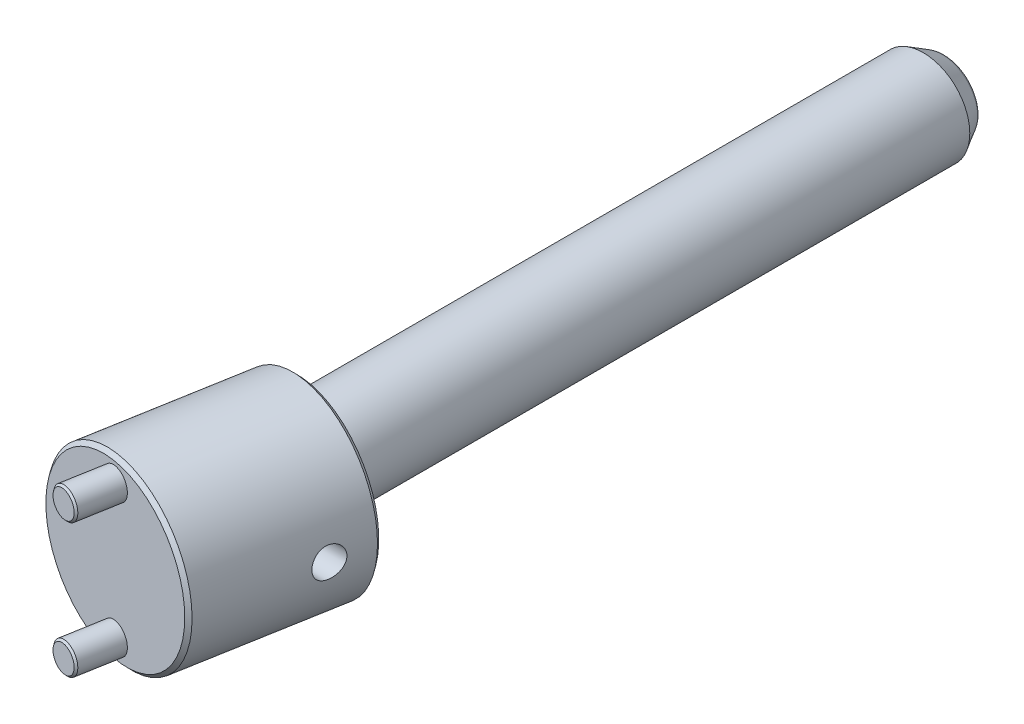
ISO-10303-21;
HEADER;
FILE_DESCRIPTION(('STEP AP214'),'2;1');
FILE_NAME('part.step','',(''),(''),'','','');
FILE_SCHEMA(('AUTOMOTIVE_DESIGN { 1 0 10303 214 1 1 1 1 }'));
ENDSEC;
DATA;
#1=APPLICATION_CONTEXT('core data for automotive mechanical design processes');
#2=APPLICATION_PROTOCOL_DEFINITION('international standard','automotive_design',2000,#1);
#3=PRODUCT_CONTEXT('',#1,'mechanical');
#4=PRODUCT('Part','Part','',(#3));
#5=PRODUCT_RELATED_PRODUCT_CATEGORY('part','',(#4));
#6=PRODUCT_DEFINITION_FORMATION('','',#4);
#7=PRODUCT_DEFINITION_CONTEXT('part definition',#1,'design');
#8=PRODUCT_DEFINITION('design','',#6,#7);
#9=PRODUCT_DEFINITION_SHAPE('','',#8);
#10=(LENGTH_UNIT() NAMED_UNIT(*) SI_UNIT(.MILLI.,.METRE.));
#11=(NAMED_UNIT(*) PLANE_ANGLE_UNIT() SI_UNIT($,.RADIAN.));
#12=(NAMED_UNIT(*) SI_UNIT($,.STERADIAN.) SOLID_ANGLE_UNIT());
#13=UNCERTAINTY_MEASURE_WITH_UNIT(LENGTH_MEASURE(1.E-05),#10,'distance_accuracy_value','');
#14=(GEOMETRIC_REPRESENTATION_CONTEXT(3) GLOBAL_UNCERTAINTY_ASSIGNED_CONTEXT((#13)) GLOBAL_UNIT_ASSIGNED_CONTEXT((#10,
#11,#12)) REPRESENTATION_CONTEXT('',''));
#15=CARTESIAN_POINT('',(0.,0.,0.));
#16=DIRECTION('',(0.,0.,1.));
#17=DIRECTION('',(1.,0.,0.));
#18=AXIS2_PLACEMENT_3D('',#15,#16,#17);
#19=CARTESIAN_POINT('',(0.,0.,-175.));
#20=DIRECTION('',(0.,0.,-1.));
#21=DIRECTION('',(0.,1.,0.));
#22=AXIS2_PLACEMENT_3D('',#19,#20,#21);
#23=PLANE('',#22);
#24=CARTESIAN_POINT('',(0.,0.,-175.));
#25=DIRECTION('',(0.,0.,1.));
#26=DIRECTION('',(-1.,0.,0.));
#27=AXIS2_PLACEMENT_3D('',#24,#25,#26);
#28=CIRCLE('',#27,7.881197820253);
#29=CARTESIAN_POINT('',(-7.881197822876,0.,-175.));
#30=VERTEX_POINT('',#29);
#31=CARTESIAN_POINT('',(7.881197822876,0.,-175.));
#32=VERTEX_POINT('',#31);
#33=EDGE_CURVE('P0_E38',#30,#32,#28,.T.);
#34=ORIENTED_EDGE('',*,*,#33,.F.);
#35=CARTESIAN_POINT('',(0.,0.,-175.));
#36=DIRECTION('',(0.,0.,1.));
#37=DIRECTION('',(1.,0.,0.));
#38=AXIS2_PLACEMENT_3D('',#35,#36,#37);
#39=CIRCLE('',#38,7.881197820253);
#40=EDGE_CURVE('P0_E42',#32,#30,#39,.T.);
#41=ORIENTED_EDGE('',*,*,#40,.F.);
#42=EDGE_LOOP('',(#34,#41));
#43=FACE_BOUND('',#42,.T.);
#44=ADVANCED_FACE('P0_F17',(#43),#23,.T.);
#45=CARTESIAN_POINT('',(0.,0.,-173.));
#46=DIRECTION('',(0.,0.,-1.));
#47=DIRECTION('',(0.999976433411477,-0.00686532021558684,0.));
#48=AXIS2_PLACEMENT_3D('',#45,#46,#47);
#49=TOROIDAL_SURFACE('',#48,7.881197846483,2.);
#50=ORIENTED_EDGE('',*,*,#33,.T.);
#51=ORIENTED_EDGE('',*,*,#40,.T.);
#52=EDGE_LOOP('',(#50,#51));
#53=FACE_BOUND('',#52,.T.);
#54=CARTESIAN_POINT('',(0.,0.,-174.000000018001));
#55=DIRECTION('',(0.,0.,1.));
#56=DIRECTION('',(1.,0.,0.));
#57=AXIS2_PLACEMENT_3D('',#54,#55,#56);
#58=CIRCLE('',#57,9.61324864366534);
#59=CARTESIAN_POINT('',(9.61324864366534,0.,-174.000000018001));
#60=VERTEX_POINT('',#59);
#61=EDGE_CURVE('P0_E48',#60,#60,#58,.T.);
#62=ORIENTED_EDGE('',*,*,#61,.F.);
#63=EDGE_LOOP('',(#62));
#64=FACE_BOUND('',#63,.T.);
#65=ADVANCED_FACE('P0_F40',(#53,#64),#49,.T.);
#66=CARTESIAN_POINT('',(0.,0.,37.5));
#67=DIRECTION('',(0.,0.,-1.));
#68=DIRECTION('',(0.,1.,0.));
#69=AXIS2_PLACEMENT_3D('',#66,#67,#68);
#70=PLANE('',#69);
#71=CARTESIAN_POINT('',(0.,0.,37.4999993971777));
#72=DIRECTION('',(0.,0.,-1.));
#73=DIRECTION('',(0.,1.,0.));
#74=AXIS2_PLACEMENT_3D('',#71,#72,#73);
#75=CIRCLE('',#74,11.4999991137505);
#76=CARTESIAN_POINT('',(0.,11.4999991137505,37.4999993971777));
#77=VERTEX_POINT('',#76);
#78=EDGE_CURVE('P0_E85',#77,#77,#75,.T.);
#79=ORIENTED_EDGE('',*,*,#78,.F.);
#80=EDGE_LOOP('',(#79));
#81=FACE_BOUND('',#80,.T.);
#82=ADVANCED_FACE('P0_F76',(#81),#70,.F.);
#83=CARTESIAN_POINT('',(4.30940107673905,0.,17.));
#84=DIRECTION('',(1.,0.,0.));
#85=DIRECTION('',(0.,0.,1.));
#86=AXIS2_PLACEMENT_3D('',#83,#84,#85);
#87=CONICAL_SURFACE('',#86,3.9999999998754,1.04719755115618);
#88=CARTESIAN_POINT('',(1.99999999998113,0.,16.9999999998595));
#89=VERTEX_POINT('',#88);
#90=VERTEX_LOOP('',#89);
#91=FACE_BOUND('',#90,.T.);
#92=CARTESIAN_POINT('',(4.309401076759,0.,17.));
#93=DIRECTION('',(1.,0.,0.));
#94=DIRECTION('',(0.,0.,1.));
#95=AXIS2_PLACEMENT_3D('',#92,#93,#94);
#96=CIRCLE('',#95,4.);
#97=CARTESIAN_POINT('',(4.309401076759,0.,21.));
#98=VERTEX_POINT('',#97);
#99=EDGE_CURVE('P0_E82',#98,#98,#96,.T.);
#100=ORIENTED_EDGE('',*,*,#99,.T.);
#101=EDGE_LOOP('',(#100));
#102=FACE_BOUND('',#101,.T.);
#103=ADVANCED_FACE('P0_F116',(#91,#102),#87,.F.);
#104=CARTESIAN_POINT('',(0.,0.,-169.000000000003));
#105=DIRECTION('',(0.,0.,1.));
#106=DIRECTION('',(0.,-1.,0.));
#107=AXIS2_PLACEMENT_3D('',#104,#105,#106);
#108=CONICAL_SURFACE('',#107,12.5000000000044,0.5235987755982);
#109=CARTESIAN_POINT('',(0.,0.,-169.));
#110=DIRECTION('',(0.,0.,-1.));
#111=DIRECTION('',(0.,1.,0.));
#112=AXIS2_PLACEMENT_3D('',#109,#110,#111);
#113=CIRCLE('',#112,12.5);
#114=CARTESIAN_POINT('',(0.,12.5,-169.));
#115=VERTEX_POINT('',#114);
#116=EDGE_CURVE('P0_E92',#115,#115,#113,.F.);
#117=ORIENTED_EDGE('',*,*,#116,.F.);
#118=EDGE_LOOP('',(#117));
#119=FACE_BOUND('',#118,.T.);
#120=ORIENTED_EDGE('',*,*,#61,.T.);
#121=EDGE_LOOP('',(#120));
#122=FACE_BOUND('',#121,.T.);
#123=ADVANCED_FACE('P0_F108',(#119,#122),#108,.T.);
#124=CARTESIAN_POINT('',(0.,0.,36.4999990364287));
#125=DIRECTION('',(0.,0.,-1.));
#126=DIRECTION('',(0.,1.,0.));
#127=AXIS2_PLACEMENT_3D('',#124,#125,#126);
#128=CONICAL_SURFACE('',#127,12.4999993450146,0.78539809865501);
#129=CARTESIAN_POINT('',(0.,0.,36.499999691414));
#130=DIRECTION('',(0.,0.,-1.));
#131=DIRECTION('',(0.,1.,0.));
#132=AXIS2_PLACEMENT_3D('',#129,#130,#131);
#133=CIRCLE('',#132,12.5);
#134=CARTESIAN_POINT('',(0.,12.5,36.499999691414));
#135=VERTEX_POINT('',#134);
#136=EDGE_CURVE('P0_E28',#135,#135,#133,.T.);
#137=ORIENTED_EDGE('',*,*,#136,.F.);
#138=EDGE_LOOP('',(#137));
#139=FACE_BOUND('',#138,.T.);
#140=ORIENTED_EDGE('',*,*,#78,.T.);
#141=EDGE_LOOP('',(#140));
#142=FACE_BOUND('',#141,.T.);
#143=ADVANCED_FACE('P0_F105',(#139,#142),#128,.T.);
#144=CARTESIAN_POINT('',(1.375,0.,17.));
#145=DIRECTION('',(1.,0.,0.));
#146=DIRECTION('',(0.,0.,1.));
#147=AXIS2_PLACEMENT_3D('',#144,#145,#146);
#148=CYLINDRICAL_SURFACE('',#147,4.);
#149=ORIENTED_EDGE('',*,*,#99,.F.);
#150=EDGE_LOOP('',(#149));
#151=FACE_BOUND('',#150,.T.);
#152=CARTESIAN_POINT('',(12.5,0.,21.));
#153=CARTESIAN_POINT('',(12.4999998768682,0.109267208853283,20.9999998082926));
#154=CARTESIAN_POINT('',(12.4985638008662,0.218537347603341,20.9955187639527));
#155=CARTESIAN_POINT('',(12.4928582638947,0.436308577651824,20.9776347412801));
#156=CARTESIAN_POINT('',(12.4885877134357,0.544809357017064,20.9642283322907));
#157=CARTESIAN_POINT('',(12.4773197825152,0.760358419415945,20.9285872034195));
#158=CARTESIAN_POINT('',(12.4703188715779,0.867404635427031,20.9063410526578));
#159=CARTESIAN_POINT('',(12.4537844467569,1.07914970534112,20.853228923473));
#160=CARTESIAN_POINT('',(12.4442499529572,1.18384763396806,20.8223596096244));
#161=CARTESIAN_POINT('',(12.412260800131,1.49277788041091,20.7173557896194));
#162=CARTESIAN_POINT('',(12.3863805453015,1.69256281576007,20.6307055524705));
#163=CARTESIAN_POINT('',(12.3281610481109,2.07458913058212,20.4268128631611));
#164=CARTESIAN_POINT('',(12.295822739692,2.25683304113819,20.3095748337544));
#165=CARTESIAN_POINT('',(12.2269279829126,2.60472253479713,20.043795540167));
#166=CARTESIAN_POINT('',(12.1902760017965,2.76972880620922,19.8944408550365));
#167=CARTESIAN_POINT('',(12.1174284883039,3.07283077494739,19.5704010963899));
#168=CARTESIAN_POINT('',(12.0812330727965,3.21091970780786,19.3957096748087));
#169=CARTESIAN_POINT('',(12.01237020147,3.45978450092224,19.0203675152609));
#170=CARTESIAN_POINT('',(11.9798194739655,3.56975347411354,18.8191582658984));
#171=CARTESIAN_POINT('',(11.9233663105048,3.75402351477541,18.399892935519));
#172=CARTESIAN_POINT('',(11.8994614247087,3.82833468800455,18.1818416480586));
#173=CARTESIAN_POINT('',(11.8640030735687,3.93682830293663,17.7422935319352));
#174=CARTESIAN_POINT('',(11.8520853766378,3.97219740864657,17.5211198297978));
#175=CARTESIAN_POINT('',(11.8408707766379,4.00551082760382,17.0756810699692));
#176=CARTESIAN_POINT('',(11.8415703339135,4.00346563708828,16.8514168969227));
#177=CARTESIAN_POINT('',(11.8551904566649,3.96293460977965,16.4160865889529));
#178=CARTESIAN_POINT('',(11.8676003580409,3.92597140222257,16.2048599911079));
#179=CARTESIAN_POINT('',(11.9024113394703,3.81912665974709,15.791778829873));
#180=CARTESIAN_POINT('',(11.9248135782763,3.74924130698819,15.5899253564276));
#181=CARTESIAN_POINT('',(11.9774670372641,3.5774893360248,15.1977500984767));
#182=CARTESIAN_POINT('',(12.0078322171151,3.47515345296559,15.0076498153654));
#183=CARTESIAN_POINT('',(12.0729382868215,3.2417276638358,14.6468343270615));
#184=CARTESIAN_POINT('',(12.107680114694,3.11063158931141,14.4761232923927));
#185=CARTESIAN_POINT('',(12.1796519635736,2.81604951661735,14.1503715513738));
#186=CARTESIAN_POINT('',(12.2169216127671,2.65131653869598,13.9964671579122));
#187=CARTESIAN_POINT('',(12.2883204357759,2.29773509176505,13.7180823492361));
#188=CARTESIAN_POINT('',(12.3224482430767,2.10887621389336,13.5936147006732));
#189=CARTESIAN_POINT('',(12.368603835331,1.8105187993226,13.4313785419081));
#190=CARTESIAN_POINT('',(12.3832112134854,1.70799133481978,13.3811846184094));
#191=CARTESIAN_POINT('',(12.4102662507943,1.49879447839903,13.2896595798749));
#192=CARTESIAN_POINT('',(12.4227147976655,1.39212681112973,13.2483248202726));
#193=CARTESIAN_POINT('',(12.4450730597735,1.17558171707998,13.1749428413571));
#194=CARTESIAN_POINT('',(12.4549867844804,1.0657096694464,13.1428809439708));
#195=CARTESIAN_POINT('',(12.4720081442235,0.843458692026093,13.0882661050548));
#196=CARTESIAN_POINT('',(12.4791170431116,0.731080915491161,13.0657088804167));
#197=CARTESIAN_POINT('',(12.4897717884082,0.515800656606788,13.0320501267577));
#198=CARTESIAN_POINT('',(12.4935992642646,0.413053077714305,13.0200402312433));
#199=CARTESIAN_POINT('',(12.498713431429,0.206871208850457,13.0040150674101));
#200=CARTESIAN_POINT('',(12.5000001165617,0.103436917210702,12.9999998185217));
#201=CARTESIAN_POINT('',(12.4999998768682,-0.109267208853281,13.0000001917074));
#202=CARTESIAN_POINT('',(12.4985638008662,-0.218537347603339,13.0044812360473));
#203=CARTESIAN_POINT('',(12.4928582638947,-0.436308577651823,13.0223652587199));
#204=CARTESIAN_POINT('',(12.4885877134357,-0.544809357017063,13.0357716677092));
#205=CARTESIAN_POINT('',(12.4773197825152,-0.760358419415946,13.0714127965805));
#206=CARTESIAN_POINT('',(12.4703188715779,-0.867404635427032,13.0936589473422));
#207=CARTESIAN_POINT('',(12.4537844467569,-1.07914970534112,13.146771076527));
#208=CARTESIAN_POINT('',(12.4442499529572,-1.18384763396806,13.1776403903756));
#209=CARTESIAN_POINT('',(12.412260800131,-1.4927778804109,13.2826442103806));
#210=CARTESIAN_POINT('',(12.3863805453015,-1.69256281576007,13.3692944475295));
#211=CARTESIAN_POINT('',(12.3281610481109,-2.07458913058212,13.5731871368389));
#212=CARTESIAN_POINT('',(12.295822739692,-2.25683304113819,13.6904251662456));
#213=CARTESIAN_POINT('',(12.2269279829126,-2.60472253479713,13.956204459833));
#214=CARTESIAN_POINT('',(12.1902760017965,-2.76972880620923,14.1055591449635));
#215=CARTESIAN_POINT('',(12.1174284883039,-3.0728307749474,14.4295989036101));
#216=CARTESIAN_POINT('',(12.0812330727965,-3.21091970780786,14.6042903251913));
#217=CARTESIAN_POINT('',(12.01237020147,-3.45978450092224,14.9796324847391));
#218=CARTESIAN_POINT('',(11.9798194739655,-3.56975347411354,15.1808417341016));
#219=CARTESIAN_POINT('',(11.9233663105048,-3.75402351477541,15.600107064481));
#220=CARTESIAN_POINT('',(11.8994614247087,-3.82833468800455,15.8181583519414));
#221=CARTESIAN_POINT('',(11.8640030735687,-3.93682830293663,16.2577064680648));
#222=CARTESIAN_POINT('',(11.8520853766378,-3.97219740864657,16.4788801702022));
#223=CARTESIAN_POINT('',(11.8408707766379,-4.00551082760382,16.9243189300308));
#224=CARTESIAN_POINT('',(11.8415703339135,-4.00346563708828,17.1485831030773));
#225=CARTESIAN_POINT('',(11.8551904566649,-3.96293460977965,17.583913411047));
#226=CARTESIAN_POINT('',(11.8676003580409,-3.92597140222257,17.7951400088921));
#227=CARTESIAN_POINT('',(11.9024113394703,-3.81912665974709,18.208221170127));
#228=CARTESIAN_POINT('',(11.9248135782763,-3.74924130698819,18.4100746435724));
#229=CARTESIAN_POINT('',(11.9774670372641,-3.5774893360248,18.8022499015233));
#230=CARTESIAN_POINT('',(12.0078322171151,-3.47515345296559,18.9923501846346));
#231=CARTESIAN_POINT('',(12.0729382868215,-3.2417276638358,19.3531656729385));
#232=CARTESIAN_POINT('',(12.107680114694,-3.11063158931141,19.5238767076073));
#233=CARTESIAN_POINT('',(12.1796519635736,-2.81604951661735,19.8496284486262));
#234=CARTESIAN_POINT('',(12.2169216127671,-2.65131653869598,20.0035328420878));
#235=CARTESIAN_POINT('',(12.2883204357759,-2.29773509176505,20.2819176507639));
#236=CARTESIAN_POINT('',(12.3224482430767,-2.10887621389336,20.4063852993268));
#237=CARTESIAN_POINT('',(12.368603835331,-1.8105187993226,20.5686214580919));
#238=CARTESIAN_POINT('',(12.3832112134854,-1.70799133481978,20.6188153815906));
#239=CARTESIAN_POINT('',(12.4102662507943,-1.49879447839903,20.7103404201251));
#240=CARTESIAN_POINT('',(12.4227147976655,-1.39212681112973,20.7516751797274));
#241=CARTESIAN_POINT('',(12.4450730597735,-1.17558171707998,20.8250571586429));
#242=CARTESIAN_POINT('',(12.4549867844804,-1.0657096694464,20.8571190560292));
#243=CARTESIAN_POINT('',(12.4720081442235,-0.843458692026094,20.9117338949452));
#244=CARTESIAN_POINT('',(12.4791170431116,-0.731080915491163,20.9342911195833));
#245=CARTESIAN_POINT('',(12.4897717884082,-0.515800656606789,20.9679498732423));
#246=CARTESIAN_POINT('',(12.4935992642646,-0.413053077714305,20.9799597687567));
#247=CARTESIAN_POINT('',(12.498713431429,-0.206871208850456,20.9959849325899));
#248=CARTESIAN_POINT('',(12.5000001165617,-0.103436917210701,21.0000001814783));
#249=CARTESIAN_POINT('',(12.5,0.,21.));
#250=B_SPLINE_CURVE_WITH_KNOTS('',3,(#152,#153,#154,#155,#156,#157,#158,#159,#160,#161,#162,
#163,#164,#165,#166,#167,#168,#169,#170,#171,#172,#173,#174,#175,#176,#177,#178,#179,#180,#181,
#182,#183,#184,#185,#186,#187,#188,#189,#190,#191,#192,#193,#194,#195,#196,#197,#198,#199,#200,
#201,#202,#203,#204,#205,#206,#207,#208,#209,#210,#211,#212,#213,#214,#215,#216,#217,#218,#219,
#220,#221,#222,#223,#224,#225,#226,#227,#228,#229,#230,#231,#232,#233,#234,#235,#236,#237,#238,
#239,#240,#241,#242,#243,#244,#245,#246,#247,#248,#249),.UNSPECIFIED.,.T.,.F.,(4,2,2,2,2,2,2,2,
2,2,2,2,2,2,2,2,2,2,2,2,2,2,2,2,2,2,2,2,2,2,2,2,2,2,2,2,2,2,2,2,2,2,2,2,2,2,2,2,4),(0.,
0.327705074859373,0.655536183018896,0.983792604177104,1.31217617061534,1.96678919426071,
2.62130761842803,3.29492000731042,3.96870146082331,4.66006760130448,5.35123768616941,
6.0207071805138,6.68998886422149,7.33137068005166,7.97282689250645,8.62401811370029,
9.27534913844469,9.95775723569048,10.6404607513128,10.9853574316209,11.3301119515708,
11.6743177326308,12.0183682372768,12.3285868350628,12.6388061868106,12.9665112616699,
13.2943423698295,13.6225987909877,13.9509823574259,14.6055953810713,15.2601138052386,
15.933726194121,16.6075076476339,17.298873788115,17.99004387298,18.6595133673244,
19.3287950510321,19.9701768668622,20.611633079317,21.2628243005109,21.9141553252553,
22.596563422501,23.2792669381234,23.6241636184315,23.9689181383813,24.3131239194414,
24.6571744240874,24.9673930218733,25.2776123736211),.UNSPECIFIED.);
#251=CARTESIAN_POINT('',(12.5,0.,21.));
#252=VERTEX_POINT('',#251);
#253=EDGE_CURVE('P0_E11',#252,#252,#250,.T.);
#254=ORIENTED_EDGE('',*,*,#253,.F.);
#255=EDGE_LOOP('',(#254));
#256=FACE_BOUND('',#255,.T.);
#257=ADVANCED_FACE('P0_F107',(#151,#256),#148,.F.);
#258=CARTESIAN_POINT('',(0.,0.,48.125));
#259=DIRECTION('',(0.,0.,-1.));
#260=DIRECTION('',(0.,1.,0.));
#261=AXIS2_PLACEMENT_3D('',#258,#259,#260);
#262=CYLINDRICAL_SURFACE('',#261,12.5);
#263=ORIENTED_EDGE('',*,*,#116,.T.);
#264=EDGE_LOOP('',(#263));
#265=FACE_BOUND('',#264,.T.);
#266=ORIENTED_EDGE('',*,*,#136,.T.);
#267=EDGE_LOOP('',(#266));
#268=FACE_BOUND('',#267,.T.);
#269=ORIENTED_EDGE('',*,*,#253,.T.);
#270=EDGE_LOOP('',(#269));
#271=FACE_BOUND('',#270,.T.);
#272=ADVANCED_FACE('P0_F102',(#265,#268,#271),#262,.T.);
#273=CLOSED_SHELL('',(#44,#65,#82,#103,#123,#143,#257,#272));
#274=MANIFOLD_SOLID_BREP('P0_B1',#273);
#275=CARTESIAN_POINT('',(-4.97390736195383,0.,57.0022828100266));
#276=DIRECTION('',(-0.173648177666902,0.,0.984807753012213));
#277=DIRECTION('',(-0.984807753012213,0.,-0.173648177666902));
#278=AXIS2_PLACEMENT_3D('',#275,#276,#277);
#279=PLANE('',#278);
#280=CARTESIAN_POINT('',(-4.97390736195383,18.,57.0022828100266));
#281=DIRECTION('',(-0.173648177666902,0.,0.984807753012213));
#282=DIRECTION('',(-0.984807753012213,0.,-0.173648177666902));
#283=AXIS2_PLACEMENT_3D('',#280,#281,#282);
#284=CIRCLE('',#283,3.50000030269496);
#285=CARTESIAN_POINT('',(-8.42073479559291,18.,56.39451413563));
#286=VERTEX_POINT('',#285);
#287=EDGE_CURVE('P1_E17',#286,#286,#284,.F.);
#288=ORIENTED_EDGE('',*,*,#287,.F.);
#289=EDGE_LOOP('',(#288));
#290=FACE_BOUND('',#289,.T.);
#291=ADVANCED_FACE('P1_F14',(#290),#279,.T.);
#292=CARTESIAN_POINT('',(-4.97390736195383,0.,57.0022828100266));
#293=DIRECTION('',(-0.173648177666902,0.,0.984807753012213));
#294=DIRECTION('',(-0.984807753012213,0.,-0.173648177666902));
#295=AXIS2_PLACEMENT_3D('',#292,#293,#294);
#296=PLANE('',#295);
#297=CARTESIAN_POINT('',(-4.97390736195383,-18.,57.0022828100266));
#298=DIRECTION('',(-0.173648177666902,0.,0.984807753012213));
#299=DIRECTION('',(-0.984807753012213,0.,-0.173648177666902));
#300=AXIS2_PLACEMENT_3D('',#297,#298,#299);
#301=CIRCLE('',#300,3.50000030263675);
#302=CARTESIAN_POINT('',(-8.42073479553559,-18.,56.3945141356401));
#303=VERTEX_POINT('',#302);
#304=EDGE_CURVE('P1_E121',#303,#303,#301,.F.);
#305=ORIENTED_EDGE('',*,*,#304,.F.);
#306=EDGE_LOOP('',(#305));
#307=FACE_BOUND('',#306,.T.);
#308=ADVANCED_FACE('P1_F111',(#307),#296,.T.);
#309=CARTESIAN_POINT('',(-3.17454396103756E-13,0.,37.4999999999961));
#310=DIRECTION('',(0.,0.,1.));
#311=DIRECTION('',(-1.,0.,0.));
#312=AXIS2_PLACEMENT_3D('',#309,#310,#311);
#313=PLANE('',#312);
#314=CARTESIAN_POINT('',(-1.48579065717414E-12,0.,37.4999999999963));
#315=DIRECTION('',(0.,0.,1.));
#316=DIRECTION('',(-1.,0.,0.));
#317=AXIS2_PLACEMENT_3D('',#314,#315,#316);
#318=CIRCLE('',#317,12.5);
#319=CARTESIAN_POINT('',(-12.5000000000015,0.,37.4999999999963));
#320=VERTEX_POINT('',#319);
#321=EDGE_CURVE('P1_E36',#320,#320,#318,.F.);
#322=ORIENTED_EDGE('',*,*,#321,.T.);
#323=EDGE_LOOP('',(#322));
#324=FACE_BOUND('',#323,.T.);
#325=ADVANCED_FACE('P1_F108',(#324),#313,.F.);
#326=CARTESIAN_POINT('',(-4.88708307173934,18.,56.5098777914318));
#327=DIRECTION('',(0.173648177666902,0.,-0.984807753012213));
#328=DIRECTION('',(0.984807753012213,0.,0.173648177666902));
#329=AXIS2_PLACEMENT_3D('',#326,#327,#328);
#330=CONICAL_SURFACE('',#329,4.00000150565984,0.785398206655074);
#331=CARTESIAN_POINT('',(-4.88708281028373,18.,56.5098763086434));
#332=DIRECTION('',(-0.173648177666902,0.,0.984807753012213));
#333=DIRECTION('',(-0.984807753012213,0.,-0.173648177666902));
#334=AXIS2_PLACEMENT_3D('',#331,#332,#333);
#335=CIRCLE('',#334,4.);
#336=CARTESIAN_POINT('',(-8.82631382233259,18.,55.8152835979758));
#337=VERTEX_POINT('',#336);
#338=EDGE_CURVE('P1_E33',#337,#337,#335,.F.);
#339=ORIENTED_EDGE('',*,*,#338,.F.);
#340=EDGE_LOOP('',(#339));
#341=FACE_BOUND('',#340,.T.);
#342=ORIENTED_EDGE('',*,*,#287,.T.);
#343=EDGE_LOOP('',(#342));
#344=FACE_BOUND('',#343,.T.);
#345=ADVANCED_FACE('P1_F104',(#341,#344),#330,.T.);
#346=CARTESIAN_POINT('',(-4.88708307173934,-18.,56.5098777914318));
#347=DIRECTION('',(0.173648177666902,0.,-0.984807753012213));
#348=DIRECTION('',(0.984807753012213,0.,0.173648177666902));
#349=AXIS2_PLACEMENT_3D('',#346,#347,#348);
#350=CONICAL_SURFACE('',#349,4.00000150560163,0.785398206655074);
#351=CARTESIAN_POINT('',(-4.88708281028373,-18.,56.5098763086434));
#352=DIRECTION('',(-0.173648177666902,0.,0.984807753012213));
#353=DIRECTION('',(-0.984807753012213,0.,-0.173648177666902));
#354=AXIS2_PLACEMENT_3D('',#351,#352,#353);
#355=CIRCLE('',#354,4.);
#356=CARTESIAN_POINT('',(-8.82631382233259,-18.,55.8152835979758));
#357=VERTEX_POINT('',#356);
#358=EDGE_CURVE('P1_E29',#357,#357,#355,.F.);
#359=ORIENTED_EDGE('',*,*,#358,.F.);
#360=EDGE_LOOP('',(#359));
#361=FACE_BOUND('',#360,.T.);
#362=ORIENTED_EDGE('',*,*,#304,.T.);
#363=EDGE_LOOP('',(#362));
#364=FACE_BOUND('',#363,.T.);
#365=ADVANCED_FACE('P1_F99',(#361,#364),#350,.T.);
#366=CARTESIAN_POINT('',(-1.48752538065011E-12,0.,-14.7263884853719));
#367=DIRECTION('',(0.,0.,1.));
#368=DIRECTION('',(-1.,0.,0.));
#369=AXIS2_PLACEMENT_3D('',#366,#367,#368);
#370=CYLINDRICAL_SURFACE('',#369,12.5);
#371=CARTESIAN_POINT('',(-1.48665801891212E-12,0.,-4.10088629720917E-12));
#372=DIRECTION('',(0.173648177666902,0.,-0.984807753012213));
#373=DIRECTION('',(0.984807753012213,0.,0.173648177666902));
#374=AXIS2_PLACEMENT_3D('',#371,#372,#373);
#375=ELLIPSE('',#374,12.6928326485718,12.5);
#376=CARTESIAN_POINT('',(12.4999999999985,0.,2.20408725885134));
#377=VERTEX_POINT('',#376);
#378=EDGE_CURVE('P1_E32',#377,#377,#375,.F.);
#379=ORIENTED_EDGE('',*,*,#378,.F.);
#380=EDGE_LOOP('',(#379));
#381=FACE_BOUND('',#380,.T.);
#382=ORIENTED_EDGE('',*,*,#321,.F.);
#383=EDGE_LOOP('',(#382));
#384=FACE_BOUND('',#383,.T.);
#385=CARTESIAN_POINT('',(12.4999999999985,0.,12.9999999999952));
#386=CARTESIAN_POINT('',(12.4999998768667,0.109267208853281,13.0000001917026));
#387=CARTESIAN_POINT('',(12.4985638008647,0.218537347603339,13.0044812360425));
#388=CARTESIAN_POINT('',(12.4928582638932,0.436308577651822,13.0223652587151));
#389=CARTESIAN_POINT('',(12.4885877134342,0.544809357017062,13.0357716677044));
#390=CARTESIAN_POINT('',(12.4773197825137,0.760358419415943,13.0714127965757));
#391=CARTESIAN_POINT('',(12.4703188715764,0.867404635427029,13.0936589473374));
#392=CARTESIAN_POINT('',(12.4537844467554,1.07914970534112,13.1467710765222));
#393=CARTESIAN_POINT('',(12.4442499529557,1.18384763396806,13.1776403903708));
#394=CARTESIAN_POINT('',(12.4122608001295,1.4927778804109,13.2826442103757));
#395=CARTESIAN_POINT('',(12.3863805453,1.69256281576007,13.3692944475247));
#396=CARTESIAN_POINT('',(12.3281610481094,2.07458913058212,13.5731871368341));
#397=CARTESIAN_POINT('',(12.2958227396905,2.25683304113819,13.6904251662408));
#398=CARTESIAN_POINT('',(12.2269279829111,2.60472253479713,13.9562044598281));
#399=CARTESIAN_POINT('',(12.190276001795,2.76972880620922,14.1055591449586));
#400=CARTESIAN_POINT('',(12.1174284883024,3.07283077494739,14.4295989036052));
#401=CARTESIAN_POINT('',(12.081233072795,3.21091970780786,14.6042903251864));
#402=CARTESIAN_POINT('',(12.0123702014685,3.45978450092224,14.9796324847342));
#403=CARTESIAN_POINT('',(11.979819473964,3.56975347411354,15.1808417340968));
#404=CARTESIAN_POINT('',(11.9233663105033,3.75402351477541,15.6001070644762));
#405=CARTESIAN_POINT('',(11.8994614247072,3.82833468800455,15.8181583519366));
#406=CARTESIAN_POINT('',(11.8640030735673,3.93682830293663,16.2577064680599));
#407=CARTESIAN_POINT('',(11.8520853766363,3.97219740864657,16.4788801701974));
#408=CARTESIAN_POINT('',(11.8408707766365,4.00551082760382,16.924318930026));
#409=CARTESIAN_POINT('',(11.841570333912,4.00346563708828,17.1485831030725));
#410=CARTESIAN_POINT('',(11.8551904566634,3.96293460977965,17.5839134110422));
#411=CARTESIAN_POINT('',(11.8676003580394,3.92597140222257,17.7951400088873));
#412=CARTESIAN_POINT('',(11.9024113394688,3.81912665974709,18.2082211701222));
#413=CARTESIAN_POINT('',(11.9248135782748,3.74924130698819,18.4100746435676));
#414=CARTESIAN_POINT('',(11.9774670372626,3.5774893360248,18.8022499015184));
#415=CARTESIAN_POINT('',(12.0078322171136,3.47515345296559,18.9923501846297));
#416=CARTESIAN_POINT('',(12.07293828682,3.2417276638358,19.3531656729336));
#417=CARTESIAN_POINT('',(12.1076801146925,3.11063158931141,19.5238767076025));
#418=CARTESIAN_POINT('',(12.1796519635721,2.81604951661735,19.8496284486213));
#419=CARTESIAN_POINT('',(12.2169216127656,2.65131653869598,20.0035328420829));
#420=CARTESIAN_POINT('',(12.2883204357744,2.29773509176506,20.2819176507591));
#421=CARTESIAN_POINT('',(12.3224482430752,2.10887621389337,20.406385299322));
#422=CARTESIAN_POINT('',(12.3686038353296,1.81051879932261,20.568621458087));
#423=CARTESIAN_POINT('',(12.3832112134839,1.70799133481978,20.6188153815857));
#424=CARTESIAN_POINT('',(12.4102662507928,1.49879447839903,20.7103404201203));
#425=CARTESIAN_POINT('',(12.422714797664,1.39212681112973,20.7516751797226));
#426=CARTESIAN_POINT('',(12.445073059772,1.17558171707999,20.825057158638));
#427=CARTESIAN_POINT('',(12.4549867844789,1.06570966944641,20.8571190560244));
#428=CARTESIAN_POINT('',(12.472008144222,0.843458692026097,20.9117338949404));
#429=CARTESIAN_POINT('',(12.4791170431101,0.731080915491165,20.9342911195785));
#430=CARTESIAN_POINT('',(12.4897717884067,0.515800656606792,20.9679498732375));
#431=CARTESIAN_POINT('',(12.4935992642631,0.413053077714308,20.9799597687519));
#432=CARTESIAN_POINT('',(12.4987134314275,0.206871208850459,20.995984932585));
#433=CARTESIAN_POINT('',(12.5000001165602,0.103436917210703,21.0000001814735));
#434=CARTESIAN_POINT('',(12.4999998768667,-0.109267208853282,20.9999998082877));
#435=CARTESIAN_POINT('',(12.4985638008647,-0.21853734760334,20.9955187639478));
#436=CARTESIAN_POINT('',(12.4928582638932,-0.436308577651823,20.9776347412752));
#437=CARTESIAN_POINT('',(12.4885877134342,-0.544809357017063,20.9642283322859));
#438=CARTESIAN_POINT('',(12.4773197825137,-0.760358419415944,20.9285872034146));
#439=CARTESIAN_POINT('',(12.4703188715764,-0.86740463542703,20.9063410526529));
#440=CARTESIAN_POINT('',(12.4537844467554,-1.07914970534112,20.8532289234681));
#441=CARTESIAN_POINT('',(12.4442499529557,-1.18384763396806,20.8223596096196));
#442=CARTESIAN_POINT('',(12.4122608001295,-1.4927778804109,20.7173557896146));
#443=CARTESIAN_POINT('',(12.3863805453,-1.69256281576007,20.6307055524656));
#444=CARTESIAN_POINT('',(12.3281610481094,-2.07458913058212,20.4268128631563));
#445=CARTESIAN_POINT('',(12.2958227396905,-2.25683304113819,20.3095748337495));
#446=CARTESIAN_POINT('',(12.2269279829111,-2.60472253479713,20.0437955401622));
#447=CARTESIAN_POINT('',(12.190276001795,-2.76972880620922,19.8944408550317));
#448=CARTESIAN_POINT('',(12.1174284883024,-3.07283077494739,19.5704010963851));
#449=CARTESIAN_POINT('',(12.081233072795,-3.21091970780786,19.3957096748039));
#450=CARTESIAN_POINT('',(12.0123702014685,-3.45978450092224,19.0203675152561));
#451=CARTESIAN_POINT('',(11.979819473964,-3.56975347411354,18.8191582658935));
#452=CARTESIAN_POINT('',(11.9233663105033,-3.75402351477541,18.3998929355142));
#453=CARTESIAN_POINT('',(11.8994614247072,-3.82833468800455,18.1818416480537));
#454=CARTESIAN_POINT('',(11.8640030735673,-3.93682830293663,17.7422935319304));
#455=CARTESIAN_POINT('',(11.8520853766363,-3.97219740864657,17.521119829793));
#456=CARTESIAN_POINT('',(11.8408707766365,-4.00551082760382,17.0756810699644));
#457=CARTESIAN_POINT('',(11.841570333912,-4.00346563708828,16.8514168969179));
#458=CARTESIAN_POINT('',(11.8551904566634,-3.96293460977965,16.4160865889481));
#459=CARTESIAN_POINT('',(11.8676003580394,-3.92597140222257,16.2048599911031));
#460=CARTESIAN_POINT('',(11.9024113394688,-3.81912665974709,15.7917788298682));
#461=CARTESIAN_POINT('',(11.9248135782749,-3.74924130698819,15.5899253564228));
#462=CARTESIAN_POINT('',(11.9774670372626,-3.5774893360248,15.1977500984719));
#463=CARTESIAN_POINT('',(12.0078322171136,-3.47515345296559,15.0076498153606));
#464=CARTESIAN_POINT('',(12.07293828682,-3.2417276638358,14.6468343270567));
#465=CARTESIAN_POINT('',(12.1076801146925,-3.11063158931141,14.4761232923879));
#466=CARTESIAN_POINT('',(12.1796519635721,-2.81604951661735,14.150371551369));
#467=CARTESIAN_POINT('',(12.2169216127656,-2.65131653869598,13.9964671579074));
#468=CARTESIAN_POINT('',(12.2883204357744,-2.29773509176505,13.7180823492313));
#469=CARTESIAN_POINT('',(12.3224482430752,-2.10887621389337,13.5936147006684));
#470=CARTESIAN_POINT('',(12.3686038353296,-1.81051879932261,13.4313785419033));
#471=CARTESIAN_POINT('',(12.3832112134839,-1.70799133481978,13.3811846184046));
#472=CARTESIAN_POINT('',(12.4102662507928,-1.49879447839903,13.28965957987));
#473=CARTESIAN_POINT('',(12.422714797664,-1.39212681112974,13.2483248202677));
#474=CARTESIAN_POINT('',(12.445073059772,-1.17558171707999,13.1749428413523));
#475=CARTESIAN_POINT('',(12.4549867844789,-1.06570966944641,13.1428809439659));
#476=CARTESIAN_POINT('',(12.472008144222,-0.843458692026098,13.08826610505));
#477=CARTESIAN_POINT('',(12.4791170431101,-0.731080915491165,13.0657088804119));
#478=CARTESIAN_POINT('',(12.4897717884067,-0.51580065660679,13.0320501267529));
#479=CARTESIAN_POINT('',(12.4935992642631,-0.413053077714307,13.0200402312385));
#480=CARTESIAN_POINT('',(12.4987134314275,-0.206871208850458,13.0040150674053));
#481=CARTESIAN_POINT('',(12.5000001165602,-0.103436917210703,12.9999998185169));
#482=CARTESIAN_POINT('',(12.4999999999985,0.,12.9999999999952));
#483=B_SPLINE_CURVE_WITH_KNOTS('',3,(#385,#386,#387,#388,#389,#390,#391,#392,#393,#394,#395,
#396,#397,#398,#399,#400,#401,#402,#403,#404,#405,#406,#407,#408,#409,#410,#411,#412,#413,#414,
#415,#416,#417,#418,#419,#420,#421,#422,#423,#424,#425,#426,#427,#428,#429,#430,#431,#432,#433,
#434,#435,#436,#437,#438,#439,#440,#441,#442,#443,#444,#445,#446,#447,#448,#449,#450,#451,#452,
#453,#454,#455,#456,#457,#458,#459,#460,#461,#462,#463,#464,#465,#466,#467,#468,#469,#470,#471,
#472,#473,#474,#475,#476,#477,#478,#479,#480,#481,#482),.UNSPECIFIED.,.T.,.F.,(4,2,2,2,2,2,2,2,
2,2,2,2,2,2,2,2,2,2,2,2,2,2,2,2,2,2,2,2,2,2,2,2,2,2,2,2,2,2,2,2,2,2,2,2,2,2,2,2,4),(0.,
0.327705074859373,0.655536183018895,0.983792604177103,1.31217617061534,1.9667891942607,
2.62130761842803,3.29492000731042,3.96870146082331,4.66006760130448,5.35123768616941,
6.0207071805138,6.6899888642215,7.33137068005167,7.97282689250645,8.62401811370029,
9.27534913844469,9.95775723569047,10.6404607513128,10.9853574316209,11.3301119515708,
11.6743177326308,12.0183682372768,12.3285868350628,12.6388061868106,12.9665112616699,
13.2943423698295,13.6225987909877,13.9509823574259,14.6055953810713,15.2601138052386,
15.933726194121,16.6075076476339,17.298873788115,17.99004387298,18.6595133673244,
19.3287950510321,19.9701768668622,20.611633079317,21.2628243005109,21.9141553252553,
22.596563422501,23.2792669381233,23.6241636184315,23.9689181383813,24.3131239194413,
24.6571744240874,24.9673930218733,25.2776123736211),.UNSPECIFIED.);
#484=CARTESIAN_POINT('',(12.4999999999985,0.,12.9999999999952));
#485=VERTEX_POINT('',#484);
#486=EDGE_CURVE('P1_E84',#485,#485,#483,.T.);
#487=ORIENTED_EDGE('',*,*,#486,.T.);
#488=EDGE_LOOP('',(#487));
#489=FACE_BOUND('',#488,.T.);
#490=ADVANCED_FACE('P1_F93',(#381,#384,#489),#370,.F.);
#491=CARTESIAN_POINT('',(-2.890129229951,18.,45.18458977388));
#492=DIRECTION('',(-0.173648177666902,0.,0.984807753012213));
#493=DIRECTION('',(-0.984807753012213,0.,-0.173648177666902));
#494=AXIS2_PLACEMENT_3D('',#491,#492,#493);
#495=CYLINDRICAL_SURFACE('',#494,4.);
#496=CARTESIAN_POINT('',(-2.890129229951,18.,45.18458977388));
#497=DIRECTION('',(-0.173648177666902,0.,0.984807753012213));
#498=DIRECTION('',(-0.984807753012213,0.,-0.173648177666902));
#499=AXIS2_PLACEMENT_3D('',#496,#497,#498);
#500=CIRCLE('',#499,4.);
#501=CARTESIAN_POINT('',(-6.82936024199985,18.,44.4899970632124));
#502=VERTEX_POINT('',#501);
#503=EDGE_CURVE('P1_E80',#502,#502,#500,.T.);
#504=ORIENTED_EDGE('',*,*,#503,.T.);
#505=EDGE_LOOP('',(#504));
#506=FACE_BOUND('',#505,.T.);
#507=ORIENTED_EDGE('',*,*,#338,.T.);
#508=EDGE_LOOP('',(#507));
#509=FACE_BOUND('',#508,.T.);
#510=ADVANCED_FACE('P1_F98',(#506,#509),#495,.T.);
#511=CARTESIAN_POINT('',(-2.890129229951,-18.,45.18458977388));
#512=DIRECTION('',(-0.173648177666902,0.,0.984807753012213));
#513=DIRECTION('',(-0.984807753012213,0.,-0.173648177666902));
#514=AXIS2_PLACEMENT_3D('',#511,#512,#513);
#515=CYLINDRICAL_SURFACE('',#514,4.);
#516=CARTESIAN_POINT('',(-2.890129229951,-18.,45.18458977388));
#517=DIRECTION('',(-0.173648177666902,0.,0.984807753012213));
#518=DIRECTION('',(-0.984807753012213,0.,-0.173648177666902));
#519=AXIS2_PLACEMENT_3D('',#516,#517,#518);
#520=CIRCLE('',#519,4.);
#521=CARTESIAN_POINT('',(-6.82936024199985,-18.,44.4899970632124));
#522=VERTEX_POINT('',#521);
#523=EDGE_CURVE('P1_E76',#522,#522,#520,.T.);
#524=ORIENTED_EDGE('',*,*,#523,.T.);
#525=EDGE_LOOP('',(#524));
#526=FACE_BOUND('',#525,.T.);
#527=ORIENTED_EDGE('',*,*,#358,.T.);
#528=EDGE_LOOP('',(#527));
#529=FACE_BOUND('',#528,.T.);
#530=ADVANCED_FACE('P1_F178',(#526,#529),#515,.T.);
#531=CARTESIAN_POINT('',(4.9240387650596,0.,0.868240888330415));
#532=DIRECTION('',(0.173648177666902,0.,-0.984807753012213));
#533=DIRECTION('',(0.984807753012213,0.,0.173648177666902));
#534=AXIS2_PLACEMENT_3D('',#531,#532,#533);
#535=PLANE('',#534);
#536=ORIENTED_EDGE('',*,*,#378,.T.);
#537=EDGE_LOOP('',(#536));
#538=FACE_BOUND('',#537,.T.);
#539=CARTESIAN_POINT('',(4.9240387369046,0.,0.868241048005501));
#540=DIRECTION('',(-0.173648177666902,0.,0.984807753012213));
#541=DIRECTION('',(-0.984807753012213,0.,-0.173648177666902));
#542=AXIS2_PLACEMENT_3D('',#539,#540,#541);
#543=CIRCLE('',#542,22.9999993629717);
#544=CARTESIAN_POINT('',(-17.7265389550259,0.,-3.12566692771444));
#545=VERTEX_POINT('',#544);
#546=EDGE_CURVE('P1_E46',#545,#545,#543,.T.);
#547=ORIENTED_EDGE('',*,*,#546,.F.);
#548=EDGE_LOOP('',(#547));
#549=FACE_BOUND('',#548,.T.);
#550=ADVANCED_FACE('P1_F71',(#538,#549),#535,.T.);
#551=CARTESIAN_POINT('',(-5.13758096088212,0.,16.9999999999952));
#552=DIRECTION('',(1.,0.,0.));
#553=DIRECTION('',(0.,0.,1.));
#554=AXIS2_PLACEMENT_3D('',#551,#552,#553);
#555=CYLINDRICAL_SURFACE('',#554,4.);
#556=ORIENTED_EDGE('',*,*,#486,.F.);
#557=EDGE_LOOP('',(#556));
#558=FACE_BOUND('',#557,.T.);
#559=CARTESIAN_POINT('',(25.744505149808,0.,20.9999999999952));
#560=CARTESIAN_POINT('',(25.7445024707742,0.224449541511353,20.9999898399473));
#561=CARTESIAN_POINT('',(25.7446167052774,0.449169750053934,20.9810345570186));
#562=CARTESIAN_POINT('',(25.7453289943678,0.892538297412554,20.9056516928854));
#563=CARTESIAN_POINT('',(25.7459279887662,1.11117398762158,20.8491513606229));
#564=CARTESIAN_POINT('',(25.7483674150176,1.53573032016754,20.7002789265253));
#565=CARTESIAN_POINT('',(25.7502069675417,1.74165985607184,20.6079322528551));
#566=CARTESIAN_POINT('',(25.7562670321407,2.13497813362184,20.390044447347));
#567=CARTESIAN_POINT('',(25.7604865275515,2.32237475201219,20.2645175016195));
#568=CARTESIAN_POINT('',(25.7726683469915,2.67318509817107,19.9840328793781));
#569=CARTESIAN_POINT('',(25.7806263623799,2.83662615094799,19.8291092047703));
#570=CARTESIAN_POINT('',(25.8016680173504,3.13511850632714,19.4942605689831));
#571=CARTESIAN_POINT('',(25.8147517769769,3.27016914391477,19.3143350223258));
#572=CARTESIAN_POINT('',(25.8471339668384,3.50750196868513,18.9357444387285));
#573=CARTESIAN_POINT('',(25.866402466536,3.60993733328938,18.737172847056));
#574=CARTESIAN_POINT('',(25.9118835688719,3.78019825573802,18.3264681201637));
#575=CARTESIAN_POINT('',(25.9380959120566,3.84802510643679,18.1143354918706));
#576=CARTESIAN_POINT('',(25.997572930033,3.94752428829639,17.6827203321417));
#577=CARTESIAN_POINT('',(26.0308378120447,3.97919555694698,17.4632375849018));
#578=CARTESIAN_POINT('',(26.1038469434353,4.00600593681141,17.0231337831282));
#579=CARTESIAN_POINT('',(26.1435917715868,4.00114178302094,16.8025126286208));
#580=CARTESIAN_POINT('',(26.229065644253,3.95514262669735,16.362291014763));
#581=CARTESIAN_POINT('',(26.2748861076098,3.91338326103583,16.1427738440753));
#582=CARTESIAN_POINT('',(26.3700904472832,3.79429562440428,15.7144041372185));
#583=CARTESIAN_POINT('',(26.4194749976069,3.71696061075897,15.5055536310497));
#584=CARTESIAN_POINT('',(26.5208851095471,3.52629970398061,15.0980923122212));
#585=CARTESIAN_POINT('',(26.5729458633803,3.41201786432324,14.8999380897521));
#586=CARTESIAN_POINT('',(26.6755217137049,3.15107738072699,14.5255913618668));
#587=CARTESIAN_POINT('',(26.7260367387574,3.00441724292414,14.3493998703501));
#588=CARTESIAN_POINT('',(26.7985014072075,2.762398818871,14.104740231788));
#589=CARTESIAN_POINT('',(26.822212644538,2.67758513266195,14.0261229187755));
#590=CARTESIAN_POINT('',(26.8680559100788,2.50123042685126,13.8763473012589));
#591=CARTESIAN_POINT('',(26.8901885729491,2.40969214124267,13.8051859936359));
#592=CARTESIAN_POINT('',(26.9325035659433,2.22040895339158,13.6708455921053));
#593=CARTESIAN_POINT('',(26.952684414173,2.12265942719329,13.6076725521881));
#594=CARTESIAN_POINT('',(26.9906967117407,1.92172314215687,13.4899387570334));
#595=CARTESIAN_POINT('',(27.0085292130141,1.81853884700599,13.4353741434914));
#596=CARTESIAN_POINT('',(27.0409975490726,1.61070575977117,13.3368810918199));
#597=CARTESIAN_POINT('',(27.0557151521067,1.50620080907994,13.2926760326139));
#598=CARTESIAN_POINT('',(27.0823402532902,1.29353992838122,13.2132295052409));
#599=CARTESIAN_POINT('',(27.0942490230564,1.18538567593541,13.1779839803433));
#600=CARTESIAN_POINT('',(27.1150068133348,0.966420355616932,13.1168404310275));
#601=CARTESIAN_POINT('',(27.1238620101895,0.855615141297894,13.0909235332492));
#602=CARTESIAN_POINT('',(27.138361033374,0.632044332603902,13.0486140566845));
#603=CARTESIAN_POINT('',(27.1440067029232,0.519279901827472,13.0322160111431));
#604=CARTESIAN_POINT('',(27.150362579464,0.338579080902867,13.0137787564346));
#605=CARTESIAN_POINT('',(27.1521456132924,0.270982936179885,13.0086139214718));
#606=CARTESIAN_POINT('',(27.1545249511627,0.135593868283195,13.0017243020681));
#607=CARTESIAN_POINT('',(27.1551212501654,0.0678009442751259,12.9999995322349));
#608=CARTESIAN_POINT('',(27.1551205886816,-0.108292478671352,13.0000007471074));
#609=CARTESIAN_POINT('',(27.1535983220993,-0.216605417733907,13.0044027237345));
#610=CARTESIAN_POINT('',(27.1475365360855,-0.432474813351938,13.0219723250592));
#611=CARTESIAN_POINT('',(27.1429954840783,-0.540030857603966,13.0351444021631));
#612=CARTESIAN_POINT('',(27.130969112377,-0.753751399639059,13.0701657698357));
#613=CARTESIAN_POINT('',(27.1234787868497,-0.859913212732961,13.0920298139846));
#614=CARTESIAN_POINT('',(27.1056974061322,-1.06990840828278,13.1442218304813));
#615=CARTESIAN_POINT('',(27.0954052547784,-1.17374086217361,13.1745531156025));
#616=CARTESIAN_POINT('',(27.0606505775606,-1.48008562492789,13.2776915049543));
#617=CARTESIAN_POINT('',(27.0322665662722,-1.67818374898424,13.3627657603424));
#618=CARTESIAN_POINT('',(26.9670024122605,-2.05691523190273,13.5626999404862));
#619=CARTESIAN_POINT('',(26.9301248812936,-2.23755393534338,13.6775507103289));
#620=CARTESIAN_POINT('',(26.8489888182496,-2.58241329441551,13.9374705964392));
#621=CARTESIAN_POINT('',(26.8045457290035,-2.74599806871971,14.0833262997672));
#622=CARTESIAN_POINT('',(26.7117479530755,-3.04675574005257,14.3990652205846));
#623=CARTESIAN_POINT('',(26.6633920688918,-3.18392050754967,14.5689558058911));
#624=CARTESIAN_POINT('',(26.5631784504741,-3.43433040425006,14.9367309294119));
#625=CARTESIAN_POINT('',(26.5112616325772,-3.54619752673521,15.1355394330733));
#626=CARTESIAN_POINT('',(26.4088825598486,-3.73470560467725,15.549577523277));
#627=CARTESIAN_POINT('',(26.3584204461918,-3.81134315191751,15.7648086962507));
#628=CARTESIAN_POINT('',(26.260845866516,-3.92773559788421,16.2086999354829));
#629=CARTESIAN_POINT('',(26.2137812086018,-3.96703393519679,16.4374907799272));
#630=CARTESIAN_POINT('',(26.1257330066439,-4.00545149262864,16.8995792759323));
#631=CARTESIAN_POINT('',(26.084748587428,-4.00457650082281,17.1328762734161));
#632=CARTESIAN_POINT('',(26.0110283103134,-3.96254464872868,17.5916982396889));
#633=CARTESIAN_POINT('',(25.9781271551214,-3.92229742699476,17.8172797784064));
#634=CARTESIAN_POINT('',(25.9198791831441,-3.80353142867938,18.2591518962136));
#635=CARTESIAN_POINT('',(25.8945313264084,-3.72501792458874,18.4754437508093));
#636=CARTESIAN_POINT('',(25.8516526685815,-3.53419920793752,18.8866686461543));
#637=CARTESIAN_POINT('',(25.8339400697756,-3.42280063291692,19.0820040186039));
#638=CARTESIAN_POINT('',(25.8045577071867,-3.16862521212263,19.4515492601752));
#639=CARTESIAN_POINT('',(25.7928872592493,-3.02585192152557,19.6257615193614));
#640=CARTESIAN_POINT('',(25.7744064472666,-2.71410714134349,19.9467489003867));
#641=CARTESIAN_POINT('',(25.7675618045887,-2.54533102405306,20.0937119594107));
#642=CARTESIAN_POINT('',(25.7572197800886,-2.18551105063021,20.3575773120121));
#643=CARTESIAN_POINT('',(25.7537238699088,-1.99445744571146,20.4744663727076));
#644=CARTESIAN_POINT('',(25.7487696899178,-1.59456350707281,20.6752839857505));
#645=CARTESIAN_POINT('',(25.7473216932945,-1.38563903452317,20.7590448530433));
#646=CARTESIAN_POINT('',(25.7454407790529,-0.956980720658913,20.890277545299));
#647=CARTESIAN_POINT('',(25.7450059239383,-0.737268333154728,20.9378185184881));
#648=CARTESIAN_POINT('',(25.7446713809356,-0.429949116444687,20.9777630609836));
#649=CARTESIAN_POINT('',(25.7446070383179,-0.344182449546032,20.9860953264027));
#650=CARTESIAN_POINT('',(25.7445244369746,-0.172290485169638,20.997215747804));
#651=CARTESIAN_POINT('',(25.7445061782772,-0.0861651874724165,21.0000039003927));
#652=CARTESIAN_POINT('',(25.744505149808,0.,20.9999999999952));
#653=B_SPLINE_CURVE_WITH_KNOTS('',3,(#559,#560,#561,#562,#563,#564,#565,#566,#567,#568,#569,
#570,#571,#572,#573,#574,#575,#576,#577,#578,#579,#580,#581,#582,#583,#584,#585,#586,#587,#588,
#589,#590,#591,#592,#593,#594,#595,#596,#597,#598,#599,#600,#601,#602,#603,#604,#605,#606,#607,
#608,#609,#610,#611,#612,#613,#614,#615,#616,#617,#618,#619,#620,#621,#622,#623,#624,#625,#626,
#627,#628,#629,#630,#631,#632,#633,#634,#635,#636,#637,#638,#639,#640,#641,#642,#643,#644,#645,
#646,#647,#648,#649,#650,#651,#652),.UNSPECIFIED.,.T.,.F.,(4,2,2,2,2,2,2,2,2,2,2,2,2,2,2,2,2,2,
2,2,2,2,2,2,2,2,2,2,2,2,2,2,2,2,2,2,2,2,2,2,2,2,2,2,2,2,4),(0.,0.673024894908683,
1.3473577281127,2.02121308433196,2.69478080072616,3.36757412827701,4.04038321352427,
4.7099841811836,5.37956013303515,6.04915576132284,6.71881122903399,7.40002082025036,
8.08135957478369,8.7819660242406,9.48260480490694,9.83640040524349,10.1900529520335,
10.5439719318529,10.8977318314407,11.2405575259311,11.5832277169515,11.9252006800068,
12.2669770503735,12.4703382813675,12.6737003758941,12.9985127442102,13.323490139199,
13.6490215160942,13.9746804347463,14.6237773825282,15.2726749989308,15.9405794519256,
16.608689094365,17.3073022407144,18.0059829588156,18.7131007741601,19.4201167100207,
20.1111747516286,20.8021376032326,21.475592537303,22.1489711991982,22.8175171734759,
23.4863568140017,24.1585398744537,24.8294364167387,25.0878075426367,25.3461788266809),.UNSPECIFIED.);
#654=CARTESIAN_POINT('',(25.744505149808,0.,20.9999999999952));
#655=VERTEX_POINT('',#654);
#656=EDGE_CURVE('P1_E39',#655,#655,#653,.T.);
#657=ORIENTED_EDGE('',*,*,#656,.F.);
#658=EDGE_LOOP('',(#657));
#659=FACE_BOUND('',#658,.T.);
#660=ADVANCED_FACE('P1_F48',(#558,#659),#555,.F.);
#661=CARTESIAN_POINT('',(-2.890129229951,0.,45.18458977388));
#662=DIRECTION('',(0.173648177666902,0.,-0.984807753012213));
#663=DIRECTION('',(0.984807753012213,0.,0.173648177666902));
#664=AXIS2_PLACEMENT_3D('',#661,#662,#663);
#665=PLANE('',#664);
#666=ORIENTED_EDGE('',*,*,#523,.F.);
#667=EDGE_LOOP('',(#666));
#668=FACE_BOUND('',#667,.T.);
#669=ORIENTED_EDGE('',*,*,#503,.F.);
#670=EDGE_LOOP('',(#669));
#671=FACE_BOUND('',#670,.T.);
#672=CARTESIAN_POINT('',(-2.89012922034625,0.,45.1845897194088));
#673=DIRECTION('',(0.173648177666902,0.,-0.984807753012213));
#674=DIRECTION('',(0.984807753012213,0.,0.173648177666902));
#675=AXIS2_PLACEMENT_3D('',#672,#673,#674);
#676=CIRCLE('',#675,22.9999993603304);
#677=CARTESIAN_POINT('',(19.760448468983,0.,49.1784976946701));
#678=VERTEX_POINT('',#677);
#679=EDGE_CURVE('P1_E26',#678,#678,#676,.T.);
#680=ORIENTED_EDGE('',*,*,#679,.F.);
#681=EDGE_LOOP('',(#680));
#682=FACE_BOUND('',#681,.T.);
#683=ADVANCED_FACE('P1_F63',(#668,#671,#682),#665,.F.);
#684=CARTESIAN_POINT('',(4.75039047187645,0.,1.85304929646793));
#685=DIRECTION('',(-0.173648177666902,0.,0.984807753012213));
#686=DIRECTION('',(-0.984807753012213,0.,-0.173648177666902));
#687=AXIS2_PLACEMENT_3D('',#684,#685,#686);
#688=CONICAL_SURFACE('',#687,23.9999998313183,0.785398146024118);
#689=ORIENTED_EDGE('',*,*,#546,.T.);
#690=EDGE_LOOP('',(#689));
#691=FACE_BOUND('',#690,.T.);
#692=CARTESIAN_POINT('',(4.7503905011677,0.,1.85304913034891));
#693=DIRECTION('',(0.173648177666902,0.,-0.984807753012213));
#694=DIRECTION('',(0.984807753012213,0.,0.173648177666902));
#695=AXIS2_PLACEMENT_3D('',#692,#693,#694);
#696=CIRCLE('',#695,24.);
#697=CARTESIAN_POINT('',(28.3857765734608,0.,6.02060539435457));
#698=VERTEX_POINT('',#697);
#699=EDGE_CURVE('P1_E21',#698,#698,#696,.F.);
#700=ORIENTED_EDGE('',*,*,#699,.F.);
#701=EDGE_LOOP('',(#700));
#702=FACE_BOUND('',#701,.T.);
#703=ADVANCED_FACE('P1_F60',(#691,#702),#688,.T.);
#704=CARTESIAN_POINT('',(-2.71648093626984,0.,44.1997813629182));
#705=DIRECTION('',(0.173648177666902,0.,-0.984807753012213));
#706=DIRECTION('',(0.984807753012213,0.,0.173648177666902));
#707=AXIS2_PLACEMENT_3D('',#704,#705,#706);
#708=CONICAL_SURFACE('',#707,23.9999999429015,0.785398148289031);
#709=CARTESIAN_POINT('',(-2.71648094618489,0.,44.1997814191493));
#710=DIRECTION('',(0.173648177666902,0.,-0.984807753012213));
#711=DIRECTION('',(0.984807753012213,0.,0.173648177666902));
#712=AXIS2_PLACEMENT_3D('',#709,#710,#711);
#713=CIRCLE('',#712,24.);
#714=CARTESIAN_POINT('',(20.9189051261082,0.,48.3673376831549));
#715=VERTEX_POINT('',#714);
#716=EDGE_CURVE('P1_E9',#715,#715,#713,.T.);
#717=ORIENTED_EDGE('',*,*,#716,.F.);
#718=EDGE_LOOP('',(#717));
#719=FACE_BOUND('',#718,.T.);
#720=ORIENTED_EDGE('',*,*,#679,.T.);
#721=EDGE_LOOP('',(#720));
#722=FACE_BOUND('',#721,.T.);
#723=ADVANCED_FACE('P1_F56',(#719,#722),#708,.T.);
#724=CARTESIAN_POINT('',(-3.28083762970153,0.,47.4004072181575));
#725=DIRECTION('',(0.173648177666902,0.,-0.984807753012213));
#726=DIRECTION('',(0.984807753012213,0.,0.173648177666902));
#727=AXIS2_PLACEMENT_3D('',#724,#725,#726);
#728=CYLINDRICAL_SURFACE('',#727,24.);
#729=ORIENTED_EDGE('',*,*,#699,.T.);
#730=EDGE_LOOP('',(#729));
#731=FACE_BOUND('',#730,.T.);
#732=ORIENTED_EDGE('',*,*,#716,.T.);
#733=EDGE_LOOP('',(#732));
#734=FACE_BOUND('',#733,.T.);
#735=ORIENTED_EDGE('',*,*,#656,.T.);
#736=EDGE_LOOP('',(#735));
#737=FACE_BOUND('',#736,.T.);
#738=ADVANCED_FACE('P1_F52',(#731,#734,#737),#728,.T.);
#739=CLOSED_SHELL('',(#291,#308,#325,#345,#365,#490,#510,#530,#550,#660,#683,#703,#723,#738));
#740=MANIFOLD_SOLID_BREP('P1_B1',#739);
#741=ADVANCED_BREP_SHAPE_REPRESENTATION('',(#18,#274,#740),#14);
#742=SHAPE_DEFINITION_REPRESENTATION(#9,#741);
ENDSEC;
END-ISO-10303-21;
